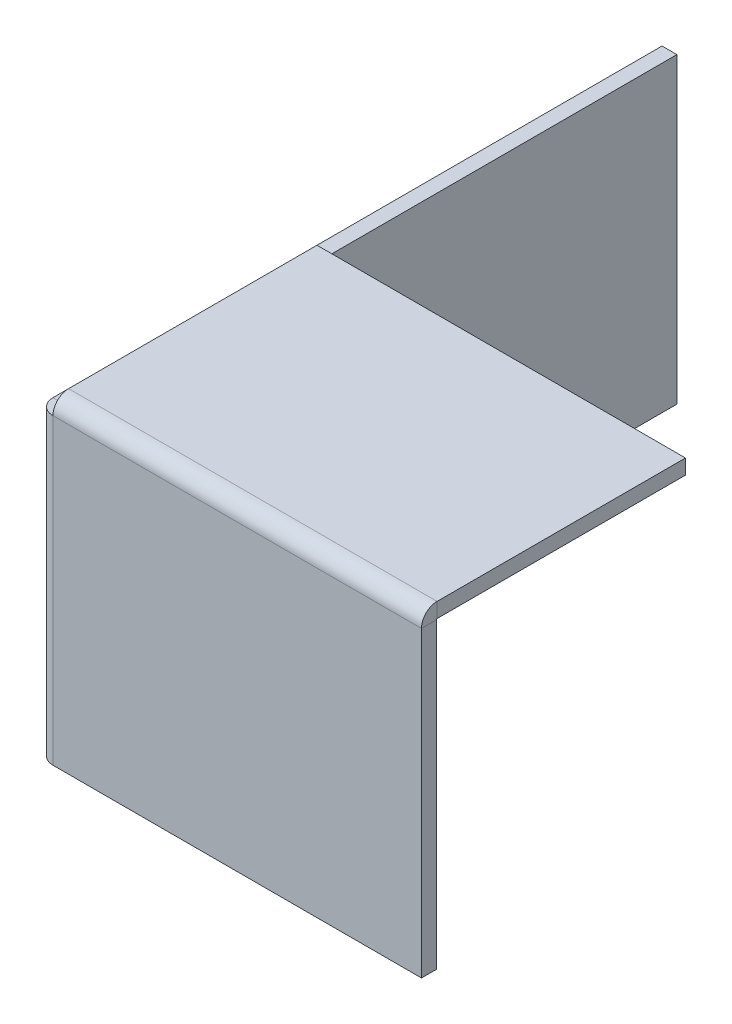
ISO-10303-21;
HEADER;
FILE_DESCRIPTION(('STEP AP214'),'2;1');
FILE_NAME('part.step','',(''),(''),'','','');
FILE_SCHEMA(('AUTOMOTIVE_DESIGN { 1 0 10303 214 1 1 1 1 }'));
ENDSEC;
DATA;
#1=APPLICATION_CONTEXT('core data for automotive mechanical design processes');
#2=APPLICATION_PROTOCOL_DEFINITION('international standard','automotive_design',2000,#1);
#3=PRODUCT_CONTEXT('',#1,'mechanical');
#4=PRODUCT('Part','Part','',(#3));
#5=PRODUCT_RELATED_PRODUCT_CATEGORY('part','',(#4));
#6=PRODUCT_DEFINITION_FORMATION('','',#4);
#7=PRODUCT_DEFINITION_CONTEXT('part definition',#1,'design');
#8=PRODUCT_DEFINITION('design','',#6,#7);
#9=PRODUCT_DEFINITION_SHAPE('','',#8);
#10=(LENGTH_UNIT() NAMED_UNIT(*) SI_UNIT(.MILLI.,.METRE.));
#11=(NAMED_UNIT(*) PLANE_ANGLE_UNIT() SI_UNIT($,.RADIAN.));
#12=(NAMED_UNIT(*) SI_UNIT($,.STERADIAN.) SOLID_ANGLE_UNIT());
#13=UNCERTAINTY_MEASURE_WITH_UNIT(LENGTH_MEASURE(1.E-05),#10,'distance_accuracy_value','');
#14=(GEOMETRIC_REPRESENTATION_CONTEXT(3) GLOBAL_UNCERTAINTY_ASSIGNED_CONTEXT((#13)) GLOBAL_UNIT_ASSIGNED_CONTEXT((#10,
#11,#12)) REPRESENTATION_CONTEXT('',''));
#15=CARTESIAN_POINT('',(0.,0.,0.));
#16=DIRECTION('',(0.,0.,1.));
#17=DIRECTION('',(1.,0.,0.));
#18=AXIS2_PLACEMENT_3D('',#15,#16,#17);
#19=CARTESIAN_POINT('',(49.5508196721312,0.,2.));
#20=DIRECTION('',(-1.,0.,0.));
#21=DIRECTION('',(0.,0.,1.));
#22=AXIS2_PLACEMENT_3D('',#19,#20,#21);
#23=PLANE('',#22);
#24=DIRECTION('',(0.,0.,1.));
#25=VECTOR('',#24,1.);
#26=CARTESIAN_POINT('',(49.5508196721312,40.7065573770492,0.));
#27=LINE('',#26,#25);
#28=CARTESIAN_POINT('',(49.5508196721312,40.7065573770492,0.));
#29=VERTEX_POINT('',#28);
#30=CARTESIAN_POINT('',(49.5508196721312,40.7065573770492,2.));
#31=VERTEX_POINT('',#30);
#32=EDGE_CURVE('E131',#29,#31,#27,.T.);
#33=ORIENTED_EDGE('',*,*,#32,.T.);
#34=DIRECTION('',(0.,1.,0.));
#35=VECTOR('',#34,1.);
#36=CARTESIAN_POINT('',(49.5508196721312,0.,2.));
#37=LINE('',#36,#35);
#38=CARTESIAN_POINT('',(49.5508196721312,0.,2.));
#39=VERTEX_POINT('',#38);
#40=EDGE_CURVE('E95',#39,#31,#37,.T.);
#41=ORIENTED_EDGE('',*,*,#40,.F.);
#42=DIRECTION('',(0.,0.,-1.));
#43=VECTOR('',#42,1.);
#44=CARTESIAN_POINT('',(49.5508196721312,0.,2.));
#45=LINE('',#44,#43);
#46=CARTESIAN_POINT('',(49.5508196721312,0.,0.));
#47=VERTEX_POINT('',#46);
#48=EDGE_CURVE('E63',#39,#47,#45,.T.);
#49=ORIENTED_EDGE('',*,*,#48,.T.);
#50=DIRECTION('',(0.,1.,0.));
#51=VECTOR('',#50,1.);
#52=CARTESIAN_POINT('',(49.5508196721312,0.,0.));
#53=LINE('',#52,#51);
#54=EDGE_CURVE('E179',#47,#29,#53,.T.);
#55=ORIENTED_EDGE('',*,*,#54,.T.);
#56=EDGE_LOOP('',(#33,#41,#49,#55));
#57=FACE_BOUND('',#56,.T.);
#58=ADVANCED_FACE('F55',(#57),#23,.F.);
#59=CARTESIAN_POINT('',(0.,40.8065573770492,2.));
#60=DIRECTION('',(0.,0.,-1.));
#61=DIRECTION('',(-1.,0.,0.));
#62=AXIS2_PLACEMENT_3D('',#59,#60,#61);
#63=PLANE('',#62);
#64=DIRECTION('',(1.,0.,0.));
#65=VECTOR('',#64,1.);
#66=CARTESIAN_POINT('',(49.5508196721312,40.7065573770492,2.));
#67=LINE('',#66,#65);
#68=CARTESIAN_POINT('',(0.,40.7065573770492,2.));
#69=VERTEX_POINT('',#68);
#70=EDGE_CURVE('E163',#31,#69,#67,.F.);
#71=ORIENTED_EDGE('',*,*,#70,.T.);
#72=DIRECTION('',(0.,-1.,0.));
#73=VECTOR('',#72,1.);
#74=CARTESIAN_POINT('',(0.,0.,2.));
#75=LINE('',#74,#73);
#76=CARTESIAN_POINT('',(0.,0.,2.));
#77=VERTEX_POINT('',#76);
#78=EDGE_CURVE('E177',#69,#77,#75,.T.);
#79=ORIENTED_EDGE('',*,*,#78,.T.);
#80=DIRECTION('',(1.,0.,0.));
#81=VECTOR('',#80,1.);
#82=CARTESIAN_POINT('',(0.,0.,2.));
#83=LINE('',#82,#81);
#84=EDGE_CURVE('E79',#77,#39,#83,.T.);
#85=ORIENTED_EDGE('',*,*,#84,.T.);
#86=ORIENTED_EDGE('',*,*,#40,.T.);
#87=EDGE_LOOP('',(#71,#79,#85,#86));
#88=FACE_BOUND('',#87,.T.);
#89=ADVANCED_FACE('F202',(#88),#63,.F.);
#90=CARTESIAN_POINT('',(0.,40.8065573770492,0.));
#91=DIRECTION('',(0.,0.,-1.));
#92=DIRECTION('',(-1.,0.,0.));
#93=AXIS2_PLACEMENT_3D('',#90,#91,#92);
#94=PLANE('',#93);
#95=DIRECTION('',(0.,-1.,0.));
#96=VECTOR('',#95,1.);
#97=CARTESIAN_POINT('',(0.,0.,0.));
#98=LINE('',#97,#96);
#99=CARTESIAN_POINT('',(0.,40.7065573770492,0.));
#100=VERTEX_POINT('',#99);
#101=CARTESIAN_POINT('',(0.,0.,0.));
#102=VERTEX_POINT('',#101);
#103=EDGE_CURVE('E175',#100,#102,#98,.T.);
#104=ORIENTED_EDGE('',*,*,#103,.F.);
#105=DIRECTION('',(1.,0.,0.));
#106=VECTOR('',#105,1.);
#107=CARTESIAN_POINT('',(49.5508196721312,40.7065573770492,0.));
#108=LINE('',#107,#106);
#109=EDGE_CURVE('E70',#29,#100,#108,.F.);
#110=ORIENTED_EDGE('',*,*,#109,.F.);
#111=ORIENTED_EDGE('',*,*,#54,.F.);
#112=DIRECTION('',(1.,0.,0.));
#113=VECTOR('',#112,1.);
#114=CARTESIAN_POINT('',(0.,0.,0.));
#115=LINE('',#114,#113);
#116=EDGE_CURVE('E89',#102,#47,#115,.T.);
#117=ORIENTED_EDGE('',*,*,#116,.F.);
#118=EDGE_LOOP('',(#104,#110,#111,#117));
#119=FACE_BOUND('',#118,.T.);
#120=ADVANCED_FACE('F186',(#119),#94,.T.);
#121=CARTESIAN_POINT('',(0.,0.,2.));
#122=DIRECTION('',(0.,1.,0.));
#123=DIRECTION('',(0.,0.,1.));
#124=AXIS2_PLACEMENT_3D('',#121,#122,#123);
#125=PLANE('',#124);
#126=ORIENTED_EDGE('',*,*,#116,.T.);
#127=ORIENTED_EDGE('',*,*,#48,.F.);
#128=ORIENTED_EDGE('',*,*,#84,.F.);
#129=DIRECTION('',(0.,0.,-1.));
#130=VECTOR('',#129,1.);
#131=CARTESIAN_POINT('',(0.,0.,2.));
#132=LINE('',#131,#130);
#133=EDGE_CURVE('E13',#77,#102,#132,.T.);
#134=ORIENTED_EDGE('',*,*,#133,.T.);
#135=EDGE_LOOP('',(#126,#127,#128,#134));
#136=FACE_BOUND('',#135,.T.);
#137=ADVANCED_FACE('F57',(#136),#125,.F.);
#138=CARTESIAN_POINT('',(0.,40.7065573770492,-0.100000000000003));
#139=DIRECTION('',(-1.,0.,0.));
#140=DIRECTION('',(0.,0.,1.));
#141=AXIS2_PLACEMENT_3D('',#138,#139,#140);
#142=PLANE('',#141);
#143=DIRECTION('',(0.,1.,0.));
#144=VECTOR('',#143,1.);
#145=CARTESIAN_POINT('',(0.,40.8065573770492,-0.100000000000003));
#146=LINE('',#145,#144);
#147=CARTESIAN_POINT('',(0.,40.8065573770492,-0.100000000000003));
#148=VERTEX_POINT('',#147);
#149=CARTESIAN_POINT('',(0.,42.8065573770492,-0.0999999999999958));
#150=VERTEX_POINT('',#149);
#151=EDGE_CURVE('E121',#148,#150,#146,.T.);
#152=ORIENTED_EDGE('',*,*,#151,.F.);
#153=CARTESIAN_POINT('',(0.,40.7065573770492,-0.100000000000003));
#154=DIRECTION('',(1.,0.,0.));
#155=DIRECTION('',(0.,0.,-1.));
#156=AXIS2_PLACEMENT_3D('',#153,#154,#155);
#157=CIRCLE('',#156,0.100000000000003);
#158=EDGE_CURVE('E115',#100,#148,#157,.F.);
#159=ORIENTED_EDGE('',*,*,#158,.F.);
#160=DIRECTION('',(0.,0.,1.));
#161=VECTOR('',#160,1.);
#162=CARTESIAN_POINT('',(0.,40.7065573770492,0.));
#163=LINE('',#162,#161);
#164=EDGE_CURVE('E172',#100,#69,#163,.T.);
#165=ORIENTED_EDGE('',*,*,#164,.T.);
#166=CARTESIAN_POINT('',(0.,40.7065573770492,-0.100000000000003));
#167=DIRECTION('',(1.,0.,0.));
#168=DIRECTION('',(0.,0.,-1.));
#169=AXIS2_PLACEMENT_3D('',#166,#167,#168);
#170=CIRCLE('',#169,2.1);
#171=EDGE_CURVE('E165',#69,#150,#170,.F.);
#172=ORIENTED_EDGE('',*,*,#171,.T.);
#173=EDGE_LOOP('',(#152,#159,#165,#172));
#174=FACE_BOUND('',#173,.T.);
#175=ADVANCED_FACE('F271',(#174),#142,.T.);
#176=CARTESIAN_POINT('',(49.5508196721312,40.7065573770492,-0.100000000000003));
#177=DIRECTION('',(-1.,0.,0.));
#178=DIRECTION('',(0.,0.,1.));
#179=AXIS2_PLACEMENT_3D('',#176,#177,#178);
#180=PLANE('',#179);
#181=CARTESIAN_POINT('',(49.5508196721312,40.7065573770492,-0.100000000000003));
#182=DIRECTION('',(1.,0.,0.));
#183=DIRECTION('',(0.,0.,-1.));
#184=AXIS2_PLACEMENT_3D('',#181,#182,#183);
#185=CIRCLE('',#184,0.100000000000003);
#186=CARTESIAN_POINT('',(49.5508196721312,40.8065573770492,-0.100000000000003));
#187=VERTEX_POINT('',#186);
#188=EDGE_CURVE('E113',#187,#29,#185,.T.);
#189=ORIENTED_EDGE('',*,*,#188,.F.);
#190=DIRECTION('',(0.,1.,0.));
#191=VECTOR('',#190,1.);
#192=CARTESIAN_POINT('',(49.5508196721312,40.8065573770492,-0.100000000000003));
#193=LINE('',#192,#191);
#194=CARTESIAN_POINT('',(49.5508196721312,42.8065573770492,-0.0999999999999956));
#195=VERTEX_POINT('',#194);
#196=EDGE_CURVE('E120',#187,#195,#193,.T.);
#197=ORIENTED_EDGE('',*,*,#196,.T.);
#198=CARTESIAN_POINT('',(49.5508196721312,40.7065573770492,-0.100000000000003));
#199=DIRECTION('',(1.,0.,0.));
#200=DIRECTION('',(0.,0.,-1.));
#201=AXIS2_PLACEMENT_3D('',#198,#199,#200);
#202=CIRCLE('',#201,2.1);
#203=EDGE_CURVE('E166',#195,#31,#202,.T.);
#204=ORIENTED_EDGE('',*,*,#203,.T.);
#205=ORIENTED_EDGE('',*,*,#32,.F.);
#206=EDGE_LOOP('',(#189,#197,#204,#205));
#207=FACE_BOUND('',#206,.T.);
#208=ADVANCED_FACE('F127',(#207),#180,.F.);
#209=CARTESIAN_POINT('',(49.5508196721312,40.7065573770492,-0.100000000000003));
#210=DIRECTION('',(1.,0.,0.));
#211=DIRECTION('',(0.,1.,0.));
#212=AXIS2_PLACEMENT_3D('',#209,#210,#211);
#213=CYLINDRICAL_SURFACE('',#212,2.1);
#214=ORIENTED_EDGE('',*,*,#70,.F.);
#215=ORIENTED_EDGE('',*,*,#203,.F.);
#216=DIRECTION('',(-1.,0.,0.));
#217=VECTOR('',#216,1.);
#218=CARTESIAN_POINT('',(0.,42.8065573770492,-0.0999999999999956));
#219=LINE('',#218,#217);
#220=EDGE_CURVE('E144',#195,#150,#219,.T.);
#221=ORIENTED_EDGE('',*,*,#220,.T.);
#222=ORIENTED_EDGE('',*,*,#171,.F.);
#223=EDGE_LOOP('',(#214,#215,#221,#222));
#224=FACE_BOUND('',#223,.T.);
#225=ADVANCED_FACE('F270',(#224),#213,.T.);
#226=CARTESIAN_POINT('',(49.5508196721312,40.7065573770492,-0.100000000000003));
#227=DIRECTION('',(1.,0.,0.));
#228=DIRECTION('',(0.,1.,0.));
#229=AXIS2_PLACEMENT_3D('',#226,#227,#228);
#230=CYLINDRICAL_SURFACE('',#229,0.100000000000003);
#231=ORIENTED_EDGE('',*,*,#109,.T.);
#232=ORIENTED_EDGE('',*,*,#158,.T.);
#233=DIRECTION('',(1.,0.,0.));
#234=VECTOR('',#233,1.);
#235=CARTESIAN_POINT('',(0.,40.8065573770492,-0.100000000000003));
#236=LINE('',#235,#234);
#237=EDGE_CURVE('E110',#148,#187,#236,.T.);
#238=ORIENTED_EDGE('',*,*,#237,.T.);
#239=ORIENTED_EDGE('',*,*,#188,.T.);
#240=EDGE_LOOP('',(#231,#232,#238,#239));
#241=FACE_BOUND('',#240,.T.);
#242=ADVANCED_FACE('F112',(#241),#230,.F.);
#243=CARTESIAN_POINT('',(49.5508196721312,42.8065573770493,-33.5));
#244=DIRECTION('',(-1.,0.,0.));
#245=DIRECTION('',(0.,0.,1.));
#246=AXIS2_PLACEMENT_3D('',#243,#244,#245);
#247=PLANE('',#246);
#248=ORIENTED_EDGE('',*,*,#196,.F.);
#249=DIRECTION('',(0.,0.,-1.));
#250=VECTOR('',#249,1.);
#251=CARTESIAN_POINT('',(49.5508196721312,40.8065573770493,-33.5));
#252=LINE('',#251,#250);
#253=CARTESIAN_POINT('',(49.5508196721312,40.8065573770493,-33.5));
#254=VERTEX_POINT('',#253);
#255=EDGE_CURVE('E140',#187,#254,#252,.T.);
#256=ORIENTED_EDGE('',*,*,#255,.T.);
#257=DIRECTION('',(0.,-1.,0.));
#258=VECTOR('',#257,1.);
#259=CARTESIAN_POINT('',(49.5508196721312,42.8065573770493,-33.5));
#260=LINE('',#259,#258);
#261=CARTESIAN_POINT('',(49.5508196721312,42.8065573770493,-33.5));
#262=VERTEX_POINT('',#261);
#263=EDGE_CURVE('E132',#262,#254,#260,.T.);
#264=ORIENTED_EDGE('',*,*,#263,.F.);
#265=DIRECTION('',(0.,0.,-1.));
#266=VECTOR('',#265,1.);
#267=CARTESIAN_POINT('',(49.5508196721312,42.8065573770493,-33.5));
#268=LINE('',#267,#266);
#269=EDGE_CURVE('E143',#195,#262,#268,.T.);
#270=ORIENTED_EDGE('',*,*,#269,.F.);
#271=EDGE_LOOP('',(#248,#256,#264,#270));
#272=FACE_BOUND('',#271,.T.);
#273=ADVANCED_FACE('F137',(#272),#247,.F.);
#274=CARTESIAN_POINT('',(0.,42.8065573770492,0.));
#275=DIRECTION('',(1.,0.,0.));
#276=DIRECTION('',(0.,0.,-1.));
#277=AXIS2_PLACEMENT_3D('',#274,#275,#276);
#278=PLANE('',#277);
#279=ORIENTED_EDGE('',*,*,#151,.T.);
#280=DIRECTION('',(0.,0.,1.));
#281=VECTOR('',#280,1.);
#282=CARTESIAN_POINT('',(0.,42.8065573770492,0.));
#283=LINE('',#282,#281);
#284=CARTESIAN_POINT('',(0.,42.8065573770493,-33.5));
#285=VERTEX_POINT('',#284);
#286=EDGE_CURVE('E155',#285,#150,#283,.T.);
#287=ORIENTED_EDGE('',*,*,#286,.F.);
#288=DIRECTION('',(0.,-1.,0.));
#289=VECTOR('',#288,1.);
#290=CARTESIAN_POINT('',(0.,42.8065573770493,-33.5));
#291=LINE('',#290,#289);
#292=CARTESIAN_POINT('',(0.,40.8065573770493,-33.5));
#293=VERTEX_POINT('',#292);
#294=EDGE_CURVE('E159',#285,#293,#291,.T.);
#295=ORIENTED_EDGE('',*,*,#294,.T.);
#296=DIRECTION('',(0.,0.,1.));
#297=VECTOR('',#296,1.);
#298=CARTESIAN_POINT('',(0.,40.8065573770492,0.));
#299=LINE('',#298,#297);
#300=EDGE_CURVE('E151',#293,#148,#299,.T.);
#301=ORIENTED_EDGE('',*,*,#300,.T.);
#302=EDGE_LOOP('',(#279,#287,#295,#301));
#303=FACE_BOUND('',#302,.T.);
#304=ADVANCED_FACE('F241',(#303),#278,.F.);
#305=CARTESIAN_POINT('',(0.,42.8065573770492,0.));
#306=DIRECTION('',(0.,-1.,0.));
#307=DIRECTION('',(0.,0.,-1.));
#308=AXIS2_PLACEMENT_3D('',#305,#306,#307);
#309=PLANE('',#308);
#310=ORIENTED_EDGE('',*,*,#220,.F.);
#311=ORIENTED_EDGE('',*,*,#269,.T.);
#312=DIRECTION('',(-1.,0.,0.));
#313=VECTOR('',#312,1.);
#314=CARTESIAN_POINT('',(0.,42.8065573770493,-33.5));
#315=LINE('',#314,#313);
#316=EDGE_CURVE('E232',#262,#285,#315,.T.);
#317=ORIENTED_EDGE('',*,*,#316,.T.);
#318=ORIENTED_EDGE('',*,*,#286,.T.);
#319=EDGE_LOOP('',(#310,#311,#317,#318));
#320=FACE_BOUND('',#319,.T.);
#321=ADVANCED_FACE('F239',(#320),#309,.F.);
#322=CARTESIAN_POINT('',(0.,40.8065573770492,0.));
#323=DIRECTION('',(0.,-1.,0.));
#324=DIRECTION('',(0.,0.,-1.));
#325=AXIS2_PLACEMENT_3D('',#322,#323,#324);
#326=PLANE('',#325);
#327=ORIENTED_EDGE('',*,*,#255,.F.);
#328=ORIENTED_EDGE('',*,*,#237,.F.);
#329=ORIENTED_EDGE('',*,*,#300,.F.);
#330=DIRECTION('',(-1.,0.,0.));
#331=VECTOR('',#330,1.);
#332=CARTESIAN_POINT('',(0.,40.8065573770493,-33.5));
#333=LINE('',#332,#331);
#334=EDGE_CURVE('E149',#254,#293,#333,.T.);
#335=ORIENTED_EDGE('',*,*,#334,.F.);
#336=EDGE_LOOP('',(#327,#328,#329,#335));
#337=FACE_BOUND('',#336,.T.);
#338=ADVANCED_FACE('F147',(#337),#326,.T.);
#339=CARTESIAN_POINT('',(0.,42.8065573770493,-33.5));
#340=DIRECTION('',(0.,0.,1.));
#341=DIRECTION('',(0.,-1.,0.));
#342=AXIS2_PLACEMENT_3D('',#339,#340,#341);
#343=PLANE('',#342);
#344=ORIENTED_EDGE('',*,*,#334,.T.);
#345=ORIENTED_EDGE('',*,*,#294,.F.);
#346=ORIENTED_EDGE('',*,*,#316,.F.);
#347=ORIENTED_EDGE('',*,*,#263,.T.);
#348=EDGE_LOOP('',(#344,#345,#346,#347));
#349=FACE_BOUND('',#348,.T.);
#350=ADVANCED_FACE('F249',(#349),#343,.F.);
#351=CARTESIAN_POINT('',(0.,0.,-0.1));
#352=DIRECTION('',(0.,-1.,0.));
#353=DIRECTION('',(1.,0.,0.));
#354=AXIS2_PLACEMENT_3D('',#351,#352,#353);
#355=PLANE('',#354);
#356=DIRECTION('',(-1.,0.,0.));
#357=VECTOR('',#356,1.);
#358=CARTESIAN_POINT('',(-2.10000000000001,0.,-0.100000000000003));
#359=LINE('',#358,#357);
#360=CARTESIAN_POINT('',(-0.1,0.,-0.0999999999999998));
#361=VERTEX_POINT('',#360);
#362=CARTESIAN_POINT('',(-2.1,0.,-0.0999999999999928));
#363=VERTEX_POINT('',#362);
#364=EDGE_CURVE('E355',#361,#363,#359,.T.);
#365=ORIENTED_EDGE('',*,*,#364,.F.);
#366=CARTESIAN_POINT('',(0.,0.,-0.1));
#367=DIRECTION('',(0.,1.,0.));
#368=DIRECTION('',(-1.,0.,0.));
#369=AXIS2_PLACEMENT_3D('',#366,#367,#368);
#370=CIRCLE('',#369,0.0999999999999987);
#371=EDGE_CURVE('E200',#102,#361,#370,.F.);
#372=ORIENTED_EDGE('',*,*,#371,.F.);
#373=ORIENTED_EDGE('',*,*,#133,.F.);
#374=CARTESIAN_POINT('',(0.,0.,-0.1));
#375=DIRECTION('',(0.,1.,0.));
#376=DIRECTION('',(-1.,0.,0.));
#377=AXIS2_PLACEMENT_3D('',#374,#375,#376);
#378=CIRCLE('',#377,2.1);
#379=EDGE_CURVE('E197',#77,#363,#378,.F.);
#380=ORIENTED_EDGE('',*,*,#379,.T.);
#381=EDGE_LOOP('',(#365,#372,#373,#380));
#382=FACE_BOUND('',#381,.T.);
#383=ADVANCED_FACE('F196',(#382),#355,.T.);
#384=CARTESIAN_POINT('',(0.,40.7065573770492,-0.1));
#385=DIRECTION('',(0.,-1.,0.));
#386=DIRECTION('',(1.,0.,0.));
#387=AXIS2_PLACEMENT_3D('',#384,#385,#386);
#388=PLANE('',#387);
#389=CARTESIAN_POINT('',(0.,40.7065573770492,-0.1));
#390=DIRECTION('',(0.,1.,0.));
#391=DIRECTION('',(-1.,0.,0.));
#392=AXIS2_PLACEMENT_3D('',#389,#390,#391);
#393=CIRCLE('',#392,0.0999999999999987);
#394=CARTESIAN_POINT('',(-0.0999999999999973,40.7065573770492,-0.0999999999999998));
#395=VERTEX_POINT('',#394);
#396=EDGE_CURVE('E224',#395,#100,#393,.T.);
#397=ORIENTED_EDGE('',*,*,#396,.F.);
#398=DIRECTION('',(-1.,0.,0.));
#399=VECTOR('',#398,1.);
#400=CARTESIAN_POINT('',(-0.1,40.7065573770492,-0.1));
#401=LINE('',#400,#399);
#402=CARTESIAN_POINT('',(-2.1,40.7065573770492,-0.0999999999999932));
#403=VERTEX_POINT('',#402);
#404=EDGE_CURVE('E220',#395,#403,#401,.T.);
#405=ORIENTED_EDGE('',*,*,#404,.T.);
#406=CARTESIAN_POINT('',(0.,40.7065573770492,-0.1));
#407=DIRECTION('',(0.,1.,0.));
#408=DIRECTION('',(-1.,0.,0.));
#409=AXIS2_PLACEMENT_3D('',#406,#407,#408);
#410=CIRCLE('',#409,2.1);
#411=EDGE_CURVE('E211',#403,#69,#410,.T.);
#412=ORIENTED_EDGE('',*,*,#411,.T.);
#413=ORIENTED_EDGE('',*,*,#164,.F.);
#414=EDGE_LOOP('',(#397,#405,#412,#413));
#415=FACE_BOUND('',#414,.T.);
#416=ADVANCED_FACE('F217',(#415),#388,.F.);
#417=CARTESIAN_POINT('',(0.,40.7065573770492,-0.1));
#418=DIRECTION('',(0.,1.,0.));
#419=DIRECTION('',(-1.,0.,0.));
#420=AXIS2_PLACEMENT_3D('',#417,#418,#419);
#421=CYLINDRICAL_SURFACE('',#420,2.1);
#422=ORIENTED_EDGE('',*,*,#78,.F.);
#423=ORIENTED_EDGE('',*,*,#411,.F.);
#424=DIRECTION('',(0.,1.,0.));
#425=VECTOR('',#424,1.);
#426=CARTESIAN_POINT('',(-2.1,0.,-0.0999999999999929));
#427=LINE('',#426,#425);
#428=EDGE_CURVE('E319',#403,#363,#427,.F.);
#429=ORIENTED_EDGE('',*,*,#428,.T.);
#430=ORIENTED_EDGE('',*,*,#379,.F.);
#431=EDGE_LOOP('',(#422,#423,#429,#430));
#432=FACE_BOUND('',#431,.T.);
#433=ADVANCED_FACE('F208',(#432),#421,.T.);
#434=CARTESIAN_POINT('',(0.,40.7065573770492,-0.1));
#435=DIRECTION('',(0.,1.,0.));
#436=DIRECTION('',(-1.,0.,0.));
#437=AXIS2_PLACEMENT_3D('',#434,#435,#436);
#438=CYLINDRICAL_SURFACE('',#437,0.0999999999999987);
#439=ORIENTED_EDGE('',*,*,#103,.T.);
#440=ORIENTED_EDGE('',*,*,#371,.T.);
#441=DIRECTION('',(0.,1.,0.));
#442=VECTOR('',#441,1.);
#443=CARTESIAN_POINT('',(-0.1,0.,-0.0999999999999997));
#444=LINE('',#443,#442);
#445=EDGE_CURVE('E353',#361,#395,#444,.T.);
#446=ORIENTED_EDGE('',*,*,#445,.T.);
#447=ORIENTED_EDGE('',*,*,#396,.T.);
#448=EDGE_LOOP('',(#439,#440,#446,#447));
#449=FACE_BOUND('',#448,.T.);
#450=ADVANCED_FACE('F289',(#449),#438,.F.);
#451=CARTESIAN_POINT('',(-2.1,40.7065573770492,0.));
#452=DIRECTION('',(0.,1.,0.));
#453=DIRECTION('',(-1.,0.,0.));
#454=AXIS2_PLACEMENT_3D('',#451,#452,#453);
#455=PLANE('',#454);
#456=DIRECTION('',(0.,0.,-1.));
#457=VECTOR('',#456,1.);
#458=CARTESIAN_POINT('',(-2.1,40.7065573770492,0.));
#459=LINE('',#458,#457);
#460=CARTESIAN_POINT('',(-2.10000000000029,40.7065573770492,-82.));
#461=VERTEX_POINT('',#460);
#462=EDGE_CURVE('E323',#461,#403,#459,.F.);
#463=ORIENTED_EDGE('',*,*,#462,.T.);
#464=ORIENTED_EDGE('',*,*,#404,.F.);
#465=DIRECTION('',(0.,0.,1.));
#466=VECTOR('',#465,1.);
#467=CARTESIAN_POINT('',(-0.0999999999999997,40.7065573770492,0.));
#468=LINE('',#467,#466);
#469=CARTESIAN_POINT('',(-0.100000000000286,40.7065573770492,-82.));
#470=VERTEX_POINT('',#469);
#471=EDGE_CURVE('E345',#470,#395,#468,.T.);
#472=ORIENTED_EDGE('',*,*,#471,.F.);
#473=DIRECTION('',(1.,0.,0.));
#474=VECTOR('',#473,1.);
#475=CARTESIAN_POINT('',(-2.10000000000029,40.7065573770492,-82.));
#476=LINE('',#475,#474);
#477=EDGE_CURVE('E228',#461,#470,#476,.T.);
#478=ORIENTED_EDGE('',*,*,#477,.F.);
#479=EDGE_LOOP('',(#463,#464,#472,#478));
#480=FACE_BOUND('',#479,.T.);
#481=ADVANCED_FACE('F293',(#480),#455,.T.);
#482=CARTESIAN_POINT('',(-2.10000000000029,0.,-82.));
#483=DIRECTION('',(0.,-1.,0.));
#484=DIRECTION('',(0.,0.,-1.));
#485=AXIS2_PLACEMENT_3D('',#482,#483,#484);
#486=PLANE('',#485);
#487=DIRECTION('',(0.,0.,-1.));
#488=VECTOR('',#487,1.);
#489=CARTESIAN_POINT('',(-0.0999999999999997,0.,0.));
#490=LINE('',#489,#488);
#491=CARTESIAN_POINT('',(-0.100000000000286,0.,-82.));
#492=VERTEX_POINT('',#491);
#493=EDGE_CURVE('E328',#361,#492,#490,.T.);
#494=ORIENTED_EDGE('',*,*,#493,.F.);
#495=ORIENTED_EDGE('',*,*,#364,.T.);
#496=DIRECTION('',(0.,0.,1.));
#497=VECTOR('',#496,1.);
#498=CARTESIAN_POINT('',(-2.10000000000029,0.,-82.));
#499=LINE('',#498,#497);
#500=CARTESIAN_POINT('',(-2.10000000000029,0.,-82.));
#501=VERTEX_POINT('',#500);
#502=EDGE_CURVE('E325',#363,#501,#499,.F.);
#503=ORIENTED_EDGE('',*,*,#502,.T.);
#504=DIRECTION('',(1.,0.,0.));
#505=VECTOR('',#504,1.);
#506=CARTESIAN_POINT('',(-2.10000000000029,0.,-82.));
#507=LINE('',#506,#505);
#508=EDGE_CURVE('E336',#501,#492,#507,.T.);
#509=ORIENTED_EDGE('',*,*,#508,.T.);
#510=EDGE_LOOP('',(#494,#495,#503,#509));
#511=FACE_BOUND('',#510,.T.);
#512=ADVANCED_FACE('F297',(#511),#486,.T.);
#513=CARTESIAN_POINT('',(-2.1,0.,0.));
#514=DIRECTION('',(1.,0.,0.));
#515=DIRECTION('',(0.,0.,-1.));
#516=AXIS2_PLACEMENT_3D('',#513,#514,#515);
#517=PLANE('',#516);
#518=ORIENTED_EDGE('',*,*,#428,.F.);
#519=ORIENTED_EDGE('',*,*,#462,.F.);
#520=DIRECTION('',(0.,-1.,0.));
#521=VECTOR('',#520,1.);
#522=CARTESIAN_POINT('',(-2.10000000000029,40.7065573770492,-82.));
#523=LINE('',#522,#521);
#524=EDGE_CURVE('E337',#501,#461,#523,.F.);
#525=ORIENTED_EDGE('',*,*,#524,.F.);
#526=ORIENTED_EDGE('',*,*,#502,.F.);
#527=EDGE_LOOP('',(#518,#519,#525,#526));
#528=FACE_BOUND('',#527,.T.);
#529=ADVANCED_FACE('F300',(#528),#517,.F.);
#530=CARTESIAN_POINT('',(-0.0999999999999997,0.,0.));
#531=DIRECTION('',(1.,0.,0.));
#532=DIRECTION('',(0.,0.,-1.));
#533=AXIS2_PLACEMENT_3D('',#530,#531,#532);
#534=PLANE('',#533);
#535=ORIENTED_EDGE('',*,*,#471,.T.);
#536=ORIENTED_EDGE('',*,*,#445,.F.);
#537=ORIENTED_EDGE('',*,*,#493,.T.);
#538=DIRECTION('',(0.,1.,0.));
#539=VECTOR('',#538,1.);
#540=CARTESIAN_POINT('',(-0.100000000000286,0.,-82.));
#541=LINE('',#540,#539);
#542=EDGE_CURVE('E347',#492,#470,#541,.T.);
#543=ORIENTED_EDGE('',*,*,#542,.T.);
#544=EDGE_LOOP('',(#535,#536,#537,#543));
#545=FACE_BOUND('',#544,.T.);
#546=ADVANCED_FACE('F305',(#545),#534,.T.);
#547=CARTESIAN_POINT('',(-2.10000000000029,40.7065573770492,-82.));
#548=DIRECTION('',(0.,0.,-1.));
#549=DIRECTION('',(-1.,0.,0.));
#550=AXIS2_PLACEMENT_3D('',#547,#548,#549);
#551=PLANE('',#550);
#552=ORIENTED_EDGE('',*,*,#542,.F.);
#553=ORIENTED_EDGE('',*,*,#508,.F.);
#554=ORIENTED_EDGE('',*,*,#524,.T.);
#555=ORIENTED_EDGE('',*,*,#477,.T.);
#556=EDGE_LOOP('',(#552,#553,#554,#555));
#557=FACE_BOUND('',#556,.T.);
#558=ADVANCED_FACE('F302',(#557),#551,.T.);
#559=CLOSED_SHELL('',(#58,#89,#120,#137,#175,#208,#225,#242,#273,#304,#321,#338,#350,#383,#416,
#433,#450,#481,#512,#529,#546,#558));
#560=MANIFOLD_SOLID_BREP('B2',#559);
#561=ADVANCED_BREP_SHAPE_REPRESENTATION('',(#18,#560),#14);
#562=SHAPE_DEFINITION_REPRESENTATION(#9,#561);
ENDSEC;
END-ISO-10303-21;
